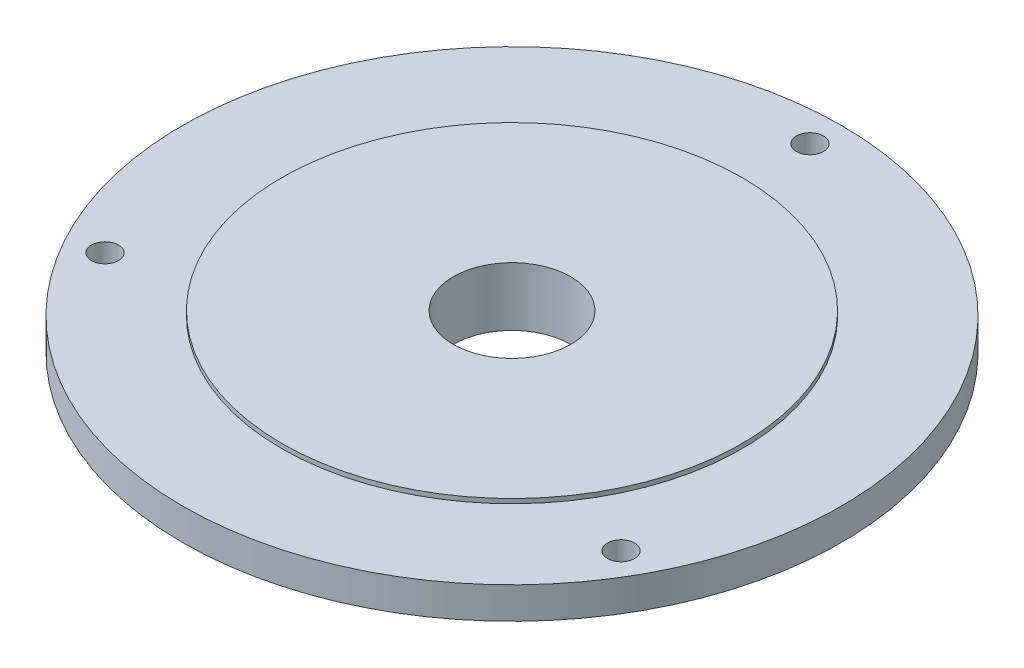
ISO-10303-21;
HEADER;
FILE_DESCRIPTION(('STEP AP214'),'2;1');
FILE_NAME('part.step','',(''),(''),'','','');
FILE_SCHEMA(('AUTOMOTIVE_DESIGN { 1 0 10303 214 1 1 1 1 }'));
ENDSEC;
DATA;
#1=APPLICATION_CONTEXT('core data for automotive mechanical design processes');
#2=APPLICATION_PROTOCOL_DEFINITION('international standard','automotive_design',2000,#1);
#3=PRODUCT_CONTEXT('',#1,'mechanical');
#4=PRODUCT('Part','Part','',(#3));
#5=PRODUCT_RELATED_PRODUCT_CATEGORY('part','',(#4));
#6=PRODUCT_DEFINITION_FORMATION('','',#4);
#7=PRODUCT_DEFINITION_CONTEXT('part definition',#1,'design');
#8=PRODUCT_DEFINITION('design','',#6,#7);
#9=PRODUCT_DEFINITION_SHAPE('','',#8);
#10=(LENGTH_UNIT() NAMED_UNIT(*) SI_UNIT(.MILLI.,.METRE.));
#11=(NAMED_UNIT(*) PLANE_ANGLE_UNIT() SI_UNIT($,.RADIAN.));
#12=(NAMED_UNIT(*) SI_UNIT($,.STERADIAN.) SOLID_ANGLE_UNIT());
#13=UNCERTAINTY_MEASURE_WITH_UNIT(LENGTH_MEASURE(1.E-05),#10,'distance_accuracy_value','');
#14=(GEOMETRIC_REPRESENTATION_CONTEXT(3) GLOBAL_UNCERTAINTY_ASSIGNED_CONTEXT((#13)) GLOBAL_UNIT_ASSIGNED_CONTEXT((#10,
#11,#12)) REPRESENTATION_CONTEXT('',''));
#15=CARTESIAN_POINT('',(0.,0.,0.));
#16=DIRECTION('',(0.,0.,1.));
#17=DIRECTION('',(1.,0.,0.));
#18=AXIS2_PLACEMENT_3D('',#15,#16,#17);
#19=CARTESIAN_POINT('',(0.,0.,0.));
#20=DIRECTION('',(0.,-1.,0.));
#21=DIRECTION('',(0.,0.,-1.));
#22=AXIS2_PLACEMENT_3D('',#19,#20,#21);
#23=CYLINDRICAL_SURFACE('',#22,25.5);
#24=CARTESIAN_POINT('',(0.,38.3859311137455,0.));
#25=DIRECTION('',(0.,-1.,0.));
#26=DIRECTION('',(0.,0.,-1.));
#27=AXIS2_PLACEMENT_3D('',#24,#25,#26);
#28=CIRCLE('',#27,25.5);
#29=CARTESIAN_POINT('',(0.,38.3859311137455,-25.5));
#30=VERTEX_POINT('',#29);
#31=EDGE_CURVE('E10',#30,#30,#28,.T.);
#32=ORIENTED_EDGE('',*,*,#31,.T.);
#33=EDGE_LOOP('',(#32));
#34=FACE_BOUND('',#33,.T.);
#35=CARTESIAN_POINT('',(0.,37.8859311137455,0.));
#36=DIRECTION('',(0.,-1.,0.));
#37=DIRECTION('',(0.,0.,-1.));
#38=AXIS2_PLACEMENT_3D('',#35,#36,#37);
#39=CIRCLE('',#38,25.5);
#40=CARTESIAN_POINT('',(0.,37.8859311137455,-25.5));
#41=VERTEX_POINT('',#40);
#42=EDGE_CURVE('E72',#41,#41,#39,.T.);
#43=ORIENTED_EDGE('',*,*,#42,.F.);
#44=EDGE_LOOP('',(#43));
#45=FACE_BOUND('',#44,.T.);
#46=ADVANCED_FACE('F37',(#34,#45),#23,.T.);
#47=CARTESIAN_POINT('',(6.5,38.3859311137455,0.));
#48=DIRECTION('',(0.,1.,0.));
#49=DIRECTION('',(0.,0.,1.));
#50=AXIS2_PLACEMENT_3D('',#47,#48,#49);
#51=PLANE('',#50);
#52=CARTESIAN_POINT('',(0.,38.3859311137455,0.));
#53=DIRECTION('',(0.,-1.,0.));
#54=DIRECTION('',(0.,0.,-1.));
#55=AXIS2_PLACEMENT_3D('',#52,#53,#54);
#56=CIRCLE('',#55,6.5);
#57=CARTESIAN_POINT('',(0.,38.3859311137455,-6.5));
#58=VERTEX_POINT('',#57);
#59=EDGE_CURVE('E44',#58,#58,#56,.T.);
#60=ORIENTED_EDGE('',*,*,#59,.T.);
#61=EDGE_LOOP('',(#60));
#62=FACE_BOUND('',#61,.T.);
#63=ORIENTED_EDGE('',*,*,#31,.F.);
#64=EDGE_LOOP('',(#63));
#65=FACE_BOUND('',#64,.T.);
#66=ADVANCED_FACE('F144',(#62,#65),#51,.T.);
#67=CARTESIAN_POINT('',(0.,0.,0.));
#68=DIRECTION('',(0.,-1.,0.));
#69=DIRECTION('',(0.,0.,-1.));
#70=AXIS2_PLACEMENT_3D('',#67,#68,#69);
#71=CYLINDRICAL_SURFACE('',#70,6.5);
#72=CARTESIAN_POINT('',(0.,31.8859311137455,0.));
#73=DIRECTION('',(0.,-1.,0.));
#74=DIRECTION('',(0.,0.,-1.));
#75=AXIS2_PLACEMENT_3D('',#72,#73,#74);
#76=CIRCLE('',#75,6.5);
#77=CARTESIAN_POINT('',(0.,31.8859311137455,-6.5));
#78=VERTEX_POINT('',#77);
#79=EDGE_CURVE('E49',#78,#78,#76,.T.);
#80=ORIENTED_EDGE('',*,*,#79,.T.);
#81=EDGE_LOOP('',(#80));
#82=FACE_BOUND('',#81,.T.);
#83=ORIENTED_EDGE('',*,*,#59,.F.);
#84=EDGE_LOOP('',(#83));
#85=FACE_BOUND('',#84,.T.);
#86=ADVANCED_FACE('F138',(#82,#85),#71,.F.);
#87=CARTESIAN_POINT('',(6.5,31.8859311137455,0.));
#88=DIRECTION('',(0.,-1.,0.));
#89=DIRECTION('',(0.,0.,-1.));
#90=AXIS2_PLACEMENT_3D('',#87,#88,#89);
#91=PLANE('',#90);
#92=CARTESIAN_POINT('',(0.,31.8859311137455,0.));
#93=DIRECTION('',(0.,-1.,0.));
#94=DIRECTION('',(0.,0.,-1.));
#95=AXIS2_PLACEMENT_3D('',#92,#93,#94);
#96=CIRCLE('',#95,14.25);
#97=CARTESIAN_POINT('',(0.,31.8859311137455,-14.25));
#98=VERTEX_POINT('',#97);
#99=EDGE_CURVE('E54',#98,#98,#96,.T.);
#100=ORIENTED_EDGE('',*,*,#99,.T.);
#101=EDGE_LOOP('',(#100));
#102=FACE_BOUND('',#101,.T.);
#103=ORIENTED_EDGE('',*,*,#79,.F.);
#104=EDGE_LOOP('',(#103));
#105=FACE_BOUND('',#104,.T.);
#106=ADVANCED_FACE('F132',(#102,#105),#91,.T.);
#107=CARTESIAN_POINT('',(0.,0.,0.));
#108=DIRECTION('',(0.,-1.,0.));
#109=DIRECTION('',(0.,0.,-1.));
#110=AXIS2_PLACEMENT_3D('',#107,#108,#109);
#111=CYLINDRICAL_SURFACE('',#110,14.25);
#112=CARTESIAN_POINT('',(0.,34.3859311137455,0.));
#113=DIRECTION('',(0.,-1.,0.));
#114=DIRECTION('',(0.,0.,-1.));
#115=AXIS2_PLACEMENT_3D('',#112,#113,#114);
#116=CIRCLE('',#115,14.25);
#117=CARTESIAN_POINT('',(0.,34.3859311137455,-14.25));
#118=VERTEX_POINT('',#117);
#119=EDGE_CURVE('E60',#118,#118,#116,.T.);
#120=ORIENTED_EDGE('',*,*,#119,.T.);
#121=EDGE_LOOP('',(#120));
#122=FACE_BOUND('',#121,.T.);
#123=ORIENTED_EDGE('',*,*,#99,.F.);
#124=EDGE_LOOP('',(#123));
#125=FACE_BOUND('',#124,.T.);
#126=ADVANCED_FACE('F125',(#122,#125),#111,.T.);
#127=CARTESIAN_POINT('',(14.25,34.3859311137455,0.));
#128=DIRECTION('',(0.,-1.,0.));
#129=DIRECTION('',(0.,0.,-1.));
#130=AXIS2_PLACEMENT_3D('',#127,#128,#129);
#131=PLANE('',#130);
#132=CARTESIAN_POINT('',(0.,34.3859311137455,-33.));
#133=DIRECTION('',(0.,-1.,0.));
#134=DIRECTION('',(0.,0.,-1.));
#135=AXIS2_PLACEMENT_3D('',#132,#133,#134);
#136=CIRCLE('',#135,1.5);
#137=CARTESIAN_POINT('',(0.,34.3859311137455,-34.5));
#138=VERTEX_POINT('',#137);
#139=EDGE_CURVE('E76',#138,#138,#136,.T.);
#140=ORIENTED_EDGE('',*,*,#139,.F.);
#141=EDGE_LOOP('',(#140));
#142=FACE_BOUND('',#141,.T.);
#143=CARTESIAN_POINT('',(28.5788383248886,34.3859311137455,16.4999999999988));
#144=DIRECTION('',(0.,-1.,0.));
#145=DIRECTION('',(0.,0.,-1.));
#146=AXIS2_PLACEMENT_3D('',#143,#144,#145);
#147=CIRCLE('',#146,1.5000000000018);
#148=CARTESIAN_POINT('',(28.5788383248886,34.3859311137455,14.999999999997));
#149=VERTEX_POINT('',#148);
#150=EDGE_CURVE('E80',#149,#149,#147,.T.);
#151=ORIENTED_EDGE('',*,*,#150,.F.);
#152=EDGE_LOOP('',(#151));
#153=FACE_BOUND('',#152,.T.);
#154=CARTESIAN_POINT('',(-28.5788383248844,34.3859311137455,16.5000000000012));
#155=DIRECTION('',(0.,-1.,0.));
#156=DIRECTION('',(0.,0.,-1.));
#157=AXIS2_PLACEMENT_3D('',#154,#155,#156);
#158=CIRCLE('',#157,1.50000000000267);
#159=CARTESIAN_POINT('',(-28.5788383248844,34.3859311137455,14.9999999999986));
#160=VERTEX_POINT('',#159);
#161=EDGE_CURVE('E84',#160,#160,#158,.T.);
#162=ORIENTED_EDGE('',*,*,#161,.F.);
#163=EDGE_LOOP('',(#162));
#164=FACE_BOUND('',#163,.T.);
#165=CARTESIAN_POINT('',(0.,34.3859311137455,0.));
#166=DIRECTION('',(0.,-1.,0.));
#167=DIRECTION('',(0.,0.,-1.));
#168=AXIS2_PLACEMENT_3D('',#165,#166,#167);
#169=CIRCLE('',#168,36.5);
#170=CARTESIAN_POINT('',(0.,34.3859311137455,-36.5));
#171=VERTEX_POINT('',#170);
#172=EDGE_CURVE('E64',#171,#171,#169,.T.);
#173=ORIENTED_EDGE('',*,*,#172,.T.);
#174=EDGE_LOOP('',(#173));
#175=FACE_BOUND('',#174,.T.);
#176=ORIENTED_EDGE('',*,*,#119,.F.);
#177=EDGE_LOOP('',(#176));
#178=FACE_BOUND('',#177,.T.);
#179=ADVANCED_FACE('F119',(#142,#153,#164,#175,#178),#131,.T.);
#180=CARTESIAN_POINT('',(0.,0.,0.));
#181=DIRECTION('',(0.,-1.,0.));
#182=DIRECTION('',(0.,0.,-1.));
#183=AXIS2_PLACEMENT_3D('',#180,#181,#182);
#184=CYLINDRICAL_SURFACE('',#183,36.5);
#185=CARTESIAN_POINT('',(0.,37.8859311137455,0.));
#186=DIRECTION('',(0.,-1.,0.));
#187=DIRECTION('',(0.,0.,-1.));
#188=AXIS2_PLACEMENT_3D('',#185,#186,#187);
#189=CIRCLE('',#188,36.5);
#190=CARTESIAN_POINT('',(0.,37.8859311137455,-36.5));
#191=VERTEX_POINT('',#190);
#192=EDGE_CURVE('E68',#191,#191,#189,.T.);
#193=ORIENTED_EDGE('',*,*,#192,.T.);
#194=EDGE_LOOP('',(#193));
#195=FACE_BOUND('',#194,.T.);
#196=ORIENTED_EDGE('',*,*,#172,.F.);
#197=EDGE_LOOP('',(#196));
#198=FACE_BOUND('',#197,.T.);
#199=ADVANCED_FACE('F107',(#195,#198),#184,.T.);
#200=CARTESIAN_POINT('',(25.5,37.8859311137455,0.));
#201=DIRECTION('',(0.,1.,0.));
#202=DIRECTION('',(0.,0.,1.));
#203=AXIS2_PLACEMENT_3D('',#200,#201,#202);
#204=PLANE('',#203);
#205=CARTESIAN_POINT('',(0.,37.8859311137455,-33.));
#206=DIRECTION('',(0.,1.,0.));
#207=DIRECTION('',(0.,0.,1.));
#208=AXIS2_PLACEMENT_3D('',#205,#206,#207);
#209=CIRCLE('',#208,1.5);
#210=CARTESIAN_POINT('',(0.,37.8859311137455,-31.5));
#211=VERTEX_POINT('',#210);
#212=EDGE_CURVE('E88',#211,#211,#209,.T.);
#213=ORIENTED_EDGE('',*,*,#212,.F.);
#214=EDGE_LOOP('',(#213));
#215=FACE_BOUND('',#214,.T.);
#216=CARTESIAN_POINT('',(28.5788383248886,37.8859311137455,16.4999999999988));
#217=DIRECTION('',(0.,1.,0.));
#218=DIRECTION('',(0.,0.,1.));
#219=AXIS2_PLACEMENT_3D('',#216,#217,#218);
#220=CIRCLE('',#219,1.5000000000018);
#221=CARTESIAN_POINT('',(28.5788383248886,37.8859311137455,18.0000000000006));
#222=VERTEX_POINT('',#221);
#223=EDGE_CURVE('E93',#222,#222,#220,.T.);
#224=ORIENTED_EDGE('',*,*,#223,.F.);
#225=EDGE_LOOP('',(#224));
#226=FACE_BOUND('',#225,.T.);
#227=CARTESIAN_POINT('',(-28.5788383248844,37.8859311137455,16.5000000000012));
#228=DIRECTION('',(0.,1.,0.));
#229=DIRECTION('',(0.,0.,1.));
#230=AXIS2_PLACEMENT_3D('',#227,#228,#229);
#231=CIRCLE('',#230,1.50000000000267);
#232=CARTESIAN_POINT('',(-28.5788383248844,37.8859311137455,18.0000000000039));
#233=VERTEX_POINT('',#232);
#234=EDGE_CURVE('E89',#233,#233,#231,.T.);
#235=ORIENTED_EDGE('',*,*,#234,.F.);
#236=EDGE_LOOP('',(#235));
#237=FACE_BOUND('',#236,.T.);
#238=ORIENTED_EDGE('',*,*,#42,.T.);
#239=EDGE_LOOP('',(#238));
#240=FACE_BOUND('',#239,.T.);
#241=ORIENTED_EDGE('',*,*,#192,.F.);
#242=EDGE_LOOP('',(#241));
#243=FACE_BOUND('',#242,.T.);
#244=ADVANCED_FACE('F103',(#215,#226,#237,#240,#243),#204,.T.);
#245=CARTESIAN_POINT('',(-28.5788383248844,31.8859311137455,16.5000000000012));
#246=DIRECTION('',(0.,1.,0.));
#247=DIRECTION('',(0.,0.,1.));
#248=AXIS2_PLACEMENT_3D('',#245,#246,#247);
#249=CYLINDRICAL_SURFACE('',#248,1.50000000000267);
#250=ORIENTED_EDGE('',*,*,#161,.T.);
#251=EDGE_LOOP('',(#250));
#252=FACE_BOUND('',#251,.T.);
#253=ORIENTED_EDGE('',*,*,#234,.T.);
#254=EDGE_LOOP('',(#253));
#255=FACE_BOUND('',#254,.T.);
#256=ADVANCED_FACE('F106',(#252,#255),#249,.F.);
#257=CARTESIAN_POINT('',(28.5788383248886,31.8859311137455,16.4999999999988));
#258=DIRECTION('',(0.,1.,0.));
#259=DIRECTION('',(0.,0.,1.));
#260=AXIS2_PLACEMENT_3D('',#257,#258,#259);
#261=CYLINDRICAL_SURFACE('',#260,1.5000000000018);
#262=ORIENTED_EDGE('',*,*,#150,.T.);
#263=EDGE_LOOP('',(#262));
#264=FACE_BOUND('',#263,.T.);
#265=ORIENTED_EDGE('',*,*,#223,.T.);
#266=EDGE_LOOP('',(#265));
#267=FACE_BOUND('',#266,.T.);
#268=ADVANCED_FACE('F200',(#264,#267),#261,.F.);
#269=CARTESIAN_POINT('',(0.,31.8859311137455,-33.));
#270=DIRECTION('',(0.,1.,0.));
#271=DIRECTION('',(0.,0.,1.));
#272=AXIS2_PLACEMENT_3D('',#269,#270,#271);
#273=CYLINDRICAL_SURFACE('',#272,1.5);
#274=ORIENTED_EDGE('',*,*,#139,.T.);
#275=EDGE_LOOP('',(#274));
#276=FACE_BOUND('',#275,.T.);
#277=ORIENTED_EDGE('',*,*,#212,.T.);
#278=EDGE_LOOP('',(#277));
#279=FACE_BOUND('',#278,.T.);
#280=ADVANCED_FACE('F101',(#276,#279),#273,.F.);
#281=CLOSED_SHELL('',(#46,#66,#86,#106,#126,#179,#199,#244,#256,#268,#280));
#282=MANIFOLD_SOLID_BREP('B2',#281);
#283=ADVANCED_BREP_SHAPE_REPRESENTATION('',(#18,#282),#14);
#284=SHAPE_DEFINITION_REPRESENTATION(#9,#283);
ENDSEC;
END-ISO-10303-21;
